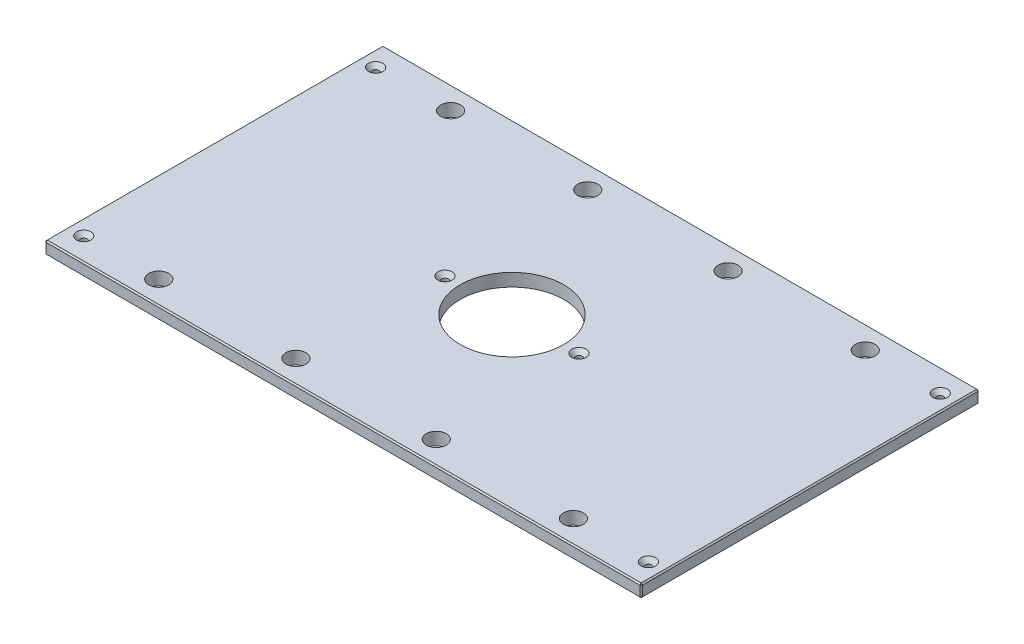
from build123d import *

# Parameters (mm, degrees)
SKETCH1_W                                        = 593.725
SKETCH1_H                                        = 336.55
BOSS_EXTRUDE1_DEPTH                              = 12.7
SKETCH13_R                                       = 51.562
CUT_EXTRUDE6_DEPTH                               = 342.474903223
F_25_32_0_78125_DIAMETER_HOLE1_D                 = 19.84375
CHAMFER2_SIZE                                    = 1.27
CSK_FOR_1_4_FLAT_HEAD_MACHINE_SCREW1_D           = 6.7564
CSK_FOR_1_4_FLAT_HEAD_MACHINE_SCREW1_CSINK_D     = 14.2748
CSK_FOR_1_4_FLAT_HEAD_MACHINE_SCREW1_CSINK_ANGLE = 82


with BuildPart() as part:
    # Sketch1 → Boss-Extrude1 (new body)
    with BuildSketch(Plane(origin=(0, 0, 0), x_dir=(1, 0, 0), z_dir=(0, 1, 0))):
        Rectangle(SKETCH1_W, SKETCH1_H)
    extrude(amount=BOSS_EXTRUDE1_DEPTH)

    # Sketch13 → Cut-Extrude6 (cut, through all)
    with BuildSketch(Plane(origin=(0, 12.7, 0), x_dir=(1, 0, 0), z_dir=(0, 1, 0))):
        with Locations(Location((0, 0, 0), (0, 0, 270))):
            Circle(SKETCH13_R)
    extrude(amount=-CUT_EXTRUDE6_DEPTH, mode=Mode.SUBTRACT)

    # 25_32 _0.78125_ Diameter Hole1 (through all)
    with Locations(Plane(origin=(0, 12.7, 0), x_dir=(1, 0, 0), z_dir=(0, 1, 0))):
        with Locations((206.375, 145.25498), (-206.375, 145.25498), (206.375, -145.25498), (-206.375, -145.25498), (-69.85, 145.25498), (69.85, 145.25498), (69.85, -145.25498), (-69.85, -145.25498)):
            Hole(F_25_32_0_78125_DIAMETER_HOLE1_D / 2)

    # Chamfer2
    chamfer2_edges = [part.edges().sort_by_distance(p)[0] for p in [
        (296.8625, 12.7, 0),
        (0, 12.7, -168.275),
        (-296.8625, 12.7, 0),
        (0, 0, -168.275),
        (296.8625, 0, 0),
        (0, 0, 168.275),
        (-296.8625, 0, 0),
        (0, 12.7, 168.275),
        (-296.8625, 6.35, -168.275),
        (296.8625, 6.35, -168.275),
        (296.8625, 6.35, 168.275),
        (-296.8625, 6.35, 168.275),
    ]]
    chamfer(chamfer2_edges, length=CHAMFER2_SIZE)

    # CSK for 1_4 Flat Head Machine Screw1 (through all)
    with Locations(Plane(origin=(0, 12.7, 0), x_dir=(1, 0, 0), z_dir=(0, 1, 0))):
        with Locations((280.9875, 145.25498), (280.9875, -145.25498), (-280.9875, -145.25498), (-66.675, 0), (66.675, 0), (-280.9875, 145.25498), (-206.375, 145.25498), (-206.375, -145.25498)):
            CounterSinkHole(CSK_FOR_1_4_FLAT_HEAD_MACHINE_SCREW1_D / 2, CSK_FOR_1_4_FLAT_HEAD_MACHINE_SCREW1_CSINK_D / 2, counter_sink_angle=CSK_FOR_1_4_FLAT_HEAD_MACHINE_SCREW1_CSINK_ANGLE)


solid = part.part
